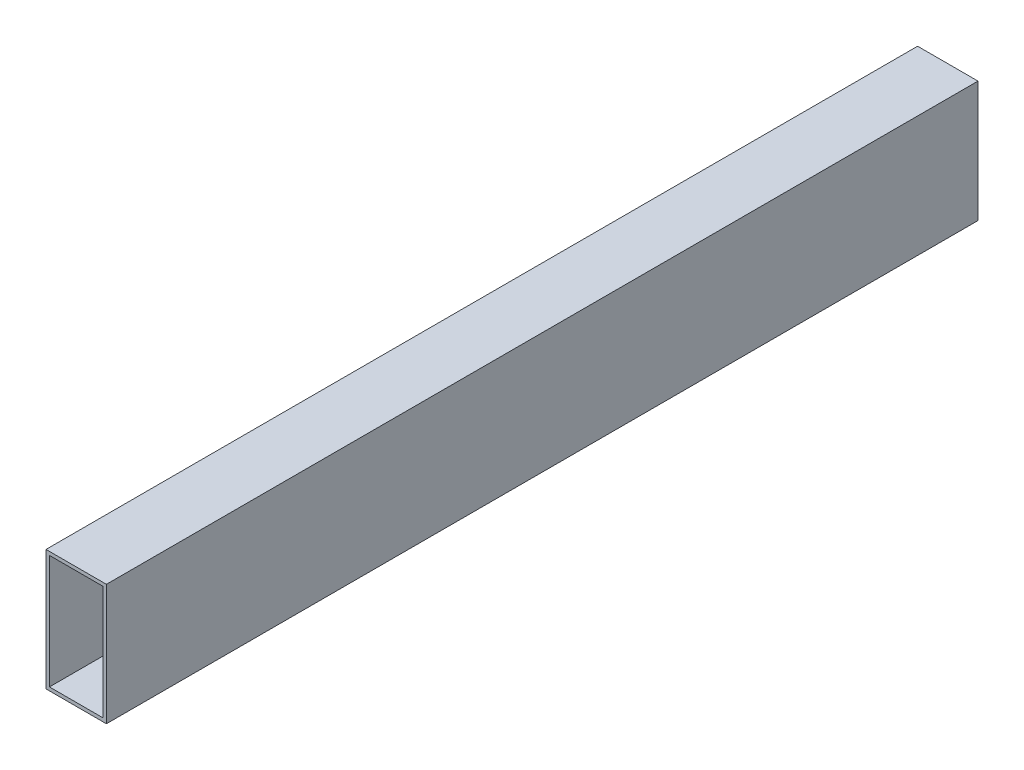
from build123d import *

# Parameters (mm, degrees)
SKETCH1_W           = 70
SKETCH1_H           = 140
SKETCH1_W_2         = 62
SKETCH1_H_2         = 132
BOSS_EXTRUDE1_DEPTH = 1010


with BuildPart() as part:
    # Sketch1 → Boss-Extrude1 (new body)
    with BuildSketch(Plane.XY):
        with Locations((35, 70)):
            Rectangle(SKETCH1_W, SKETCH1_H)
        with Locations((35, 70)):
            Rectangle(SKETCH1_W_2, SKETCH1_H_2, mode=Mode.SUBTRACT)
    extrude(amount=BOSS_EXTRUDE1_DEPTH)


solid = part.part
